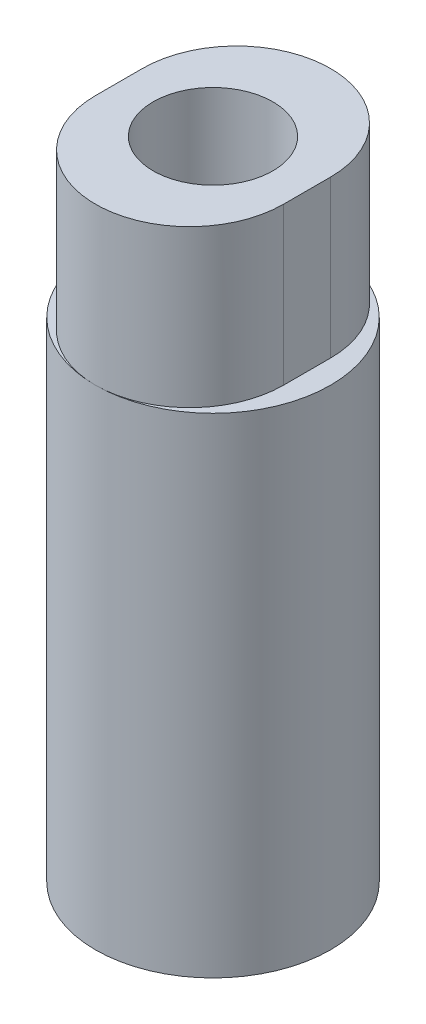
ISO-10303-21;
HEADER;
FILE_DESCRIPTION(('STEP AP214'),'2;1');
FILE_NAME('part.step','',(''),(''),'','','');
FILE_SCHEMA(('AUTOMOTIVE_DESIGN { 1 0 10303 214 1 1 1 1 }'));
ENDSEC;
DATA;
#1=APPLICATION_CONTEXT('core data for automotive mechanical design processes');
#2=APPLICATION_PROTOCOL_DEFINITION('international standard','automotive_design',2000,#1);
#3=PRODUCT_CONTEXT('',#1,'mechanical');
#4=PRODUCT('Part','Part','',(#3));
#5=PRODUCT_RELATED_PRODUCT_CATEGORY('part','',(#4));
#6=PRODUCT_DEFINITION_FORMATION('','',#4);
#7=PRODUCT_DEFINITION_CONTEXT('part definition',#1,'design');
#8=PRODUCT_DEFINITION('design','',#6,#7);
#9=PRODUCT_DEFINITION_SHAPE('','',#8);
#10=(LENGTH_UNIT() NAMED_UNIT(*) SI_UNIT(.MILLI.,.METRE.));
#11=(NAMED_UNIT(*) PLANE_ANGLE_UNIT() SI_UNIT($,.RADIAN.));
#12=(NAMED_UNIT(*) SI_UNIT($,.STERADIAN.) SOLID_ANGLE_UNIT());
#13=UNCERTAINTY_MEASURE_WITH_UNIT(LENGTH_MEASURE(1.E-05),#10,'distance_accuracy_value','');
#14=(GEOMETRIC_REPRESENTATION_CONTEXT(3) GLOBAL_UNCERTAINTY_ASSIGNED_CONTEXT((#13)) GLOBAL_UNIT_ASSIGNED_CONTEXT((#10,
#11,#12)) REPRESENTATION_CONTEXT('',''));
#15=CARTESIAN_POINT('',(0.,0.,0.));
#16=DIRECTION('',(0.,0.,1.));
#17=DIRECTION('',(1.,0.,0.));
#18=AXIS2_PLACEMENT_3D('',#15,#16,#17);
#19=CARTESIAN_POINT('',(4.76250000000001,19.812,0.));
#20=DIRECTION('',(0.,-1.,0.));
#21=DIRECTION('',(1.,0.,0.));
#22=AXIS2_PLACEMENT_3D('',#19,#20,#21);
#23=PLANE('',#22);
#24=DIRECTION('',(0.,0.,-1.));
#25=VECTOR('',#24,1.);
#26=CARTESIAN_POINT('',(3.80999999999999,19.812,-0.9525));
#27=LINE('',#26,#25);
#28=CARTESIAN_POINT('',(3.80999999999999,19.812,0.9525));
#29=VERTEX_POINT('',#28);
#30=CARTESIAN_POINT('',(3.80999999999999,19.812,-0.9525));
#31=VERTEX_POINT('',#30);
#32=EDGE_CURVE('E46',#29,#31,#27,.T.);
#33=ORIENTED_EDGE('',*,*,#32,.F.);
#34=CARTESIAN_POINT('',(0.,19.812,0.9525));
#35=DIRECTION('',(0.,1.,0.));
#36=DIRECTION('',(-1.,0.,0.));
#37=AXIS2_PLACEMENT_3D('',#34,#35,#36);
#38=CIRCLE('',#37,3.81);
#39=CARTESIAN_POINT('',(-1.01246779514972E-13,19.812,4.76249999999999));
#40=VERTEX_POINT('',#39);
#41=EDGE_CURVE('E11',#40,#29,#38,.T.);
#42=ORIENTED_EDGE('',*,*,#41,.F.);
#43=CARTESIAN_POINT('',(0.,19.812,0.));
#44=DIRECTION('',(0.,1.,0.));
#45=DIRECTION('',(-1.,0.,0.));
#46=AXIS2_PLACEMENT_3D('',#43,#44,#45);
#47=CIRCLE('',#46,4.76249999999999);
#48=CARTESIAN_POINT('',(-1.01246779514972E-13,19.812,-4.76249999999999));
#49=VERTEX_POINT('',#48);
#50=EDGE_CURVE('E105',#40,#49,#47,.T.);
#51=ORIENTED_EDGE('',*,*,#50,.T.);
#52=CARTESIAN_POINT('',(0.,19.812,-0.9525));
#53=DIRECTION('',(0.,1.,0.));
#54=DIRECTION('',(1.,0.,0.));
#55=AXIS2_PLACEMENT_3D('',#52,#53,#54);
#56=CIRCLE('',#55,3.81);
#57=EDGE_CURVE('E50',#31,#49,#56,.T.);
#58=ORIENTED_EDGE('',*,*,#57,.F.);
#59=EDGE_LOOP('',(#33,#42,#51,#58));
#60=FACE_BOUND('',#59,.T.);
#61=ADVANCED_FACE('F28',(#60),#23,.F.);
#62=CARTESIAN_POINT('',(-3.81000000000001,19.812,-0.9525));
#63=VERTEX_POINT('',#62);
#64=EDGE_CURVE('E37',#49,#63,#56,.T.);
#65=ORIENTED_EDGE('',*,*,#64,.F.);
#66=EDGE_CURVE('E81',#49,#40,#47,.T.);
#67=ORIENTED_EDGE('',*,*,#66,.T.);
#68=CARTESIAN_POINT('',(-3.81000000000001,19.812,0.9525));
#69=VERTEX_POINT('',#68);
#70=EDGE_CURVE('E39',#69,#40,#38,.T.);
#71=ORIENTED_EDGE('',*,*,#70,.F.);
#72=DIRECTION('',(0.,0.,1.));
#73=VECTOR('',#72,1.);
#74=CARTESIAN_POINT('',(-3.81000000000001,19.812,-0.9525));
#75=LINE('',#74,#73);
#76=EDGE_CURVE('E78',#63,#69,#75,.T.);
#77=ORIENTED_EDGE('',*,*,#76,.F.);
#78=EDGE_LOOP('',(#65,#67,#71,#77));
#79=FACE_BOUND('',#78,.T.);
#80=ADVANCED_FACE('F77',(#79),#23,.F.);
#81=CARTESIAN_POINT('',(0.,77.724,0.));
#82=DIRECTION('',(0.,1.,0.));
#83=DIRECTION('',(-1.,0.,0.));
#84=AXIS2_PLACEMENT_3D('',#81,#82,#83);
#85=CYLINDRICAL_SURFACE('',#84,4.76249999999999);
#86=ORIENTED_EDGE('',*,*,#50,.F.);
#87=ORIENTED_EDGE('',*,*,#66,.F.);
#88=EDGE_LOOP('',(#86,#87));
#89=FACE_BOUND('',#88,.T.);
#90=CARTESIAN_POINT('',(0.,0.,0.));
#91=DIRECTION('',(0.,1.,0.));
#92=DIRECTION('',(-1.,0.,0.));
#93=AXIS2_PLACEMENT_3D('',#90,#91,#92);
#94=CIRCLE('',#93,4.76249999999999);
#95=CARTESIAN_POINT('',(-4.76249999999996,0.,0.));
#96=VERTEX_POINT('',#95);
#97=EDGE_CURVE('E32',#96,#96,#94,.T.);
#98=ORIENTED_EDGE('',*,*,#97,.T.);
#99=EDGE_LOOP('',(#98));
#100=FACE_BOUND('',#99,.T.);
#101=ADVANCED_FACE('F30',(#89,#100),#85,.T.);
#102=CARTESIAN_POINT('',(4.76250000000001,0.,0.));
#103=DIRECTION('',(0.,1.,0.));
#104=DIRECTION('',(-1.,0.,0.));
#105=AXIS2_PLACEMENT_3D('',#102,#103,#104);
#106=PLANE('',#105);
#107=ORIENTED_EDGE('',*,*,#97,.F.);
#108=EDGE_LOOP('',(#107));
#109=FACE_BOUND('',#108,.T.);
#110=CARTESIAN_POINT('',(0.,0.,0.));
#111=DIRECTION('',(0.,1.,0.));
#112=DIRECTION('',(-1.,0.,0.));
#113=AXIS2_PLACEMENT_3D('',#110,#111,#112);
#114=CIRCLE('',#113,3.97509999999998);
#115=CARTESIAN_POINT('',(-3.97509999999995,0.,0.));
#116=VERTEX_POINT('',#115);
#117=EDGE_CURVE('E109',#116,#116,#114,.T.);
#118=ORIENTED_EDGE('',*,*,#117,.T.);
#119=EDGE_LOOP('',(#118));
#120=FACE_BOUND('',#119,.T.);
#121=ADVANCED_FACE('F163',(#109,#120),#106,.F.);
#122=CARTESIAN_POINT('',(0.,77.724,0.));
#123=DIRECTION('',(0.,1.,0.));
#124=DIRECTION('',(-1.,0.,0.));
#125=AXIS2_PLACEMENT_3D('',#122,#123,#124);
#126=CYLINDRICAL_SURFACE('',#125,3.97509999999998);
#127=ORIENTED_EDGE('',*,*,#117,.F.);
#128=EDGE_LOOP('',(#127));
#129=FACE_BOUND('',#128,.T.);
#130=CARTESIAN_POINT('',(0.,5.08000000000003,0.));
#131=DIRECTION('',(0.,1.,0.));
#132=DIRECTION('',(-1.,0.,0.));
#133=AXIS2_PLACEMENT_3D('',#130,#131,#132);
#134=CIRCLE('',#133,3.97509999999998);
#135=CARTESIAN_POINT('',(-3.97509999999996,5.08000000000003,0.));
#136=VERTEX_POINT('',#135);
#137=EDGE_CURVE('E107',#136,#136,#134,.T.);
#138=ORIENTED_EDGE('',*,*,#137,.T.);
#139=EDGE_LOOP('',(#138));
#140=FACE_BOUND('',#139,.T.);
#141=ADVANCED_FACE('F154',(#129,#140),#126,.F.);
#142=CARTESIAN_POINT('',(3.97510000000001,5.08000000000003,0.));
#143=DIRECTION('',(0.,1.,0.));
#144=DIRECTION('',(-1.,0.,0.));
#145=AXIS2_PLACEMENT_3D('',#142,#143,#144);
#146=PLANE('',#145);
#147=CARTESIAN_POINT('',(0.,5.08000000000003,0.));
#148=DIRECTION('',(0.,1.,0.));
#149=DIRECTION('',(-1.,0.,0.));
#150=AXIS2_PLACEMENT_3D('',#147,#148,#149);
#151=CIRCLE('',#150,2.4257);
#152=CARTESIAN_POINT('',(-2.4257,5.08000000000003,0.));
#153=VERTEX_POINT('',#152);
#154=EDGE_CURVE('E119',#153,#153,#151,.T.);
#155=ORIENTED_EDGE('',*,*,#154,.T.);
#156=EDGE_LOOP('',(#155));
#157=FACE_BOUND('',#156,.T.);
#158=ORIENTED_EDGE('',*,*,#137,.F.);
#159=EDGE_LOOP('',(#158));
#160=FACE_BOUND('',#159,.T.);
#161=ADVANCED_FACE('F147',(#157,#160),#146,.F.);
#162=CARTESIAN_POINT('',(0.,26.162,-0.9525));
#163=DIRECTION('',(0.,-1.,0.));
#164=DIRECTION('',(1.,0.,0.));
#165=AXIS2_PLACEMENT_3D('',#162,#163,#164);
#166=CYLINDRICAL_SURFACE('',#165,3.81);
#167=ORIENTED_EDGE('',*,*,#57,.T.);
#168=ORIENTED_EDGE('',*,*,#64,.T.);
#169=DIRECTION('',(0.,-1.,0.));
#170=VECTOR('',#169,1.);
#171=CARTESIAN_POINT('',(-3.81000000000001,26.162,-0.9525));
#172=LINE('',#171,#170);
#173=CARTESIAN_POINT('',(-3.81000000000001,26.162,-0.9525));
#174=VERTEX_POINT('',#173);
#175=EDGE_CURVE('E92',#174,#63,#172,.T.);
#176=ORIENTED_EDGE('',*,*,#175,.F.);
#177=CARTESIAN_POINT('',(0.,26.162,-0.9525));
#178=DIRECTION('',(0.,1.,0.));
#179=DIRECTION('',(1.,0.,0.));
#180=AXIS2_PLACEMENT_3D('',#177,#178,#179);
#181=CIRCLE('',#180,3.81);
#182=CARTESIAN_POINT('',(3.80999999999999,26.162,-0.9525));
#183=VERTEX_POINT('',#182);
#184=EDGE_CURVE('E139',#183,#174,#181,.T.);
#185=ORIENTED_EDGE('',*,*,#184,.F.);
#186=DIRECTION('',(0.,-1.,0.));
#187=VECTOR('',#186,1.);
#188=CARTESIAN_POINT('',(3.80999999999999,26.162,-0.9525));
#189=LINE('',#188,#187);
#190=EDGE_CURVE('E101',#183,#31,#189,.T.);
#191=ORIENTED_EDGE('',*,*,#190,.T.);
#192=EDGE_LOOP('',(#167,#168,#176,#185,#191));
#193=FACE_BOUND('',#192,.T.);
#194=ADVANCED_FACE('F145',(#193),#166,.T.);
#195=CARTESIAN_POINT('',(-3.81000000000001,26.162,-0.9525));
#196=DIRECTION('',(1.,0.,0.));
#197=DIRECTION('',(0.,1.,0.));
#198=AXIS2_PLACEMENT_3D('',#195,#196,#197);
#199=PLANE('',#198);
#200=ORIENTED_EDGE('',*,*,#76,.T.);
#201=DIRECTION('',(0.,-1.,0.));
#202=VECTOR('',#201,1.);
#203=CARTESIAN_POINT('',(-3.81000000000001,26.162,0.9525));
#204=LINE('',#203,#202);
#205=CARTESIAN_POINT('',(-3.81000000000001,26.162,0.9525));
#206=VERTEX_POINT('',#205);
#207=EDGE_CURVE('E89',#206,#69,#204,.T.);
#208=ORIENTED_EDGE('',*,*,#207,.F.);
#209=DIRECTION('',(0.,0.,1.));
#210=VECTOR('',#209,1.);
#211=CARTESIAN_POINT('',(-3.81000000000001,26.162,-0.9525));
#212=LINE('',#211,#210);
#213=EDGE_CURVE('E140',#174,#206,#212,.T.);
#214=ORIENTED_EDGE('',*,*,#213,.F.);
#215=ORIENTED_EDGE('',*,*,#175,.T.);
#216=EDGE_LOOP('',(#200,#208,#214,#215));
#217=FACE_BOUND('',#216,.T.);
#218=ADVANCED_FACE('F88',(#217),#199,.F.);
#219=CARTESIAN_POINT('',(0.,26.162,0.9525));
#220=DIRECTION('',(0.,-1.,0.));
#221=DIRECTION('',(1.,0.,0.));
#222=AXIS2_PLACEMENT_3D('',#219,#220,#221);
#223=CYLINDRICAL_SURFACE('',#222,3.81);
#224=ORIENTED_EDGE('',*,*,#70,.T.);
#225=ORIENTED_EDGE('',*,*,#41,.T.);
#226=DIRECTION('',(0.,-1.,0.));
#227=VECTOR('',#226,1.);
#228=CARTESIAN_POINT('',(3.80999999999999,26.162,0.9525));
#229=LINE('',#228,#227);
#230=CARTESIAN_POINT('',(3.80999999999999,26.162,0.9525));
#231=VERTEX_POINT('',#230);
#232=EDGE_CURVE('E97',#231,#29,#229,.T.);
#233=ORIENTED_EDGE('',*,*,#232,.F.);
#234=CARTESIAN_POINT('',(0.,26.162,0.9525));
#235=DIRECTION('',(0.,1.,0.));
#236=DIRECTION('',(-1.,0.,0.));
#237=AXIS2_PLACEMENT_3D('',#234,#235,#236);
#238=CIRCLE('',#237,3.81);
#239=EDGE_CURVE('E96',#206,#231,#238,.T.);
#240=ORIENTED_EDGE('',*,*,#239,.F.);
#241=ORIENTED_EDGE('',*,*,#207,.T.);
#242=EDGE_LOOP('',(#224,#225,#233,#240,#241));
#243=FACE_BOUND('',#242,.T.);
#244=ADVANCED_FACE('F94',(#243),#223,.T.);
#245=CARTESIAN_POINT('',(3.80999999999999,26.162,-0.9525));
#246=DIRECTION('',(-1.,0.,0.));
#247=DIRECTION('',(0.,-1.,0.));
#248=AXIS2_PLACEMENT_3D('',#245,#246,#247);
#249=PLANE('',#248);
#250=ORIENTED_EDGE('',*,*,#32,.T.);
#251=ORIENTED_EDGE('',*,*,#190,.F.);
#252=DIRECTION('',(0.,0.,-1.));
#253=VECTOR('',#252,1.);
#254=CARTESIAN_POINT('',(3.80999999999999,26.162,-0.9525));
#255=LINE('',#254,#253);
#256=EDGE_CURVE('E142',#231,#183,#255,.T.);
#257=ORIENTED_EDGE('',*,*,#256,.F.);
#258=ORIENTED_EDGE('',*,*,#232,.T.);
#259=EDGE_LOOP('',(#250,#251,#257,#258));
#260=FACE_BOUND('',#259,.T.);
#261=ADVANCED_FACE('F135',(#260),#249,.F.);
#262=CARTESIAN_POINT('',(0.,26.162,-0.9525));
#263=DIRECTION('',(0.,-1.,0.));
#264=DIRECTION('',(1.,0.,0.));
#265=AXIS2_PLACEMENT_3D('',#262,#263,#264);
#266=PLANE('',#265);
#267=CARTESIAN_POINT('',(0.,26.162,0.));
#268=DIRECTION('',(0.,1.,0.));
#269=DIRECTION('',(-1.,0.,0.));
#270=AXIS2_PLACEMENT_3D('',#267,#268,#269);
#271=CIRCLE('',#270,2.4257);
#272=CARTESIAN_POINT('',(-2.42570000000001,26.162,0.));
#273=VERTEX_POINT('',#272);
#274=EDGE_CURVE('E122',#273,#273,#271,.T.);
#275=ORIENTED_EDGE('',*,*,#274,.F.);
#276=EDGE_LOOP('',(#275));
#277=FACE_BOUND('',#276,.T.);
#278=ORIENTED_EDGE('',*,*,#184,.T.);
#279=ORIENTED_EDGE('',*,*,#213,.T.);
#280=ORIENTED_EDGE('',*,*,#239,.T.);
#281=ORIENTED_EDGE('',*,*,#256,.T.);
#282=EDGE_LOOP('',(#278,#279,#280,#281));
#283=FACE_BOUND('',#282,.T.);
#284=ADVANCED_FACE('F132',(#277,#283),#266,.F.);
#285=CARTESIAN_POINT('',(0.,0.,0.));
#286=DIRECTION('',(0.,1.,0.));
#287=DIRECTION('',(-1.,0.,0.));
#288=AXIS2_PLACEMENT_3D('',#285,#286,#287);
#289=CYLINDRICAL_SURFACE('',#288,2.4257);
#290=ORIENTED_EDGE('',*,*,#274,.T.);
#291=EDGE_LOOP('',(#290));
#292=FACE_BOUND('',#291,.T.);
#293=ORIENTED_EDGE('',*,*,#154,.F.);
#294=EDGE_LOOP('',(#293));
#295=FACE_BOUND('',#294,.T.);
#296=ADVANCED_FACE('F129',(#292,#295),#289,.F.);
#297=CLOSED_SHELL('',(#61,#80,#101,#121,#141,#161,#194,#218,#244,#261,#284,#296));
#298=MANIFOLD_SOLID_BREP('B2',#297);
#299=ADVANCED_BREP_SHAPE_REPRESENTATION('',(#18,#298),#14);
#300=SHAPE_DEFINITION_REPRESENTATION(#9,#299);
ENDSEC;
END-ISO-10303-21;
